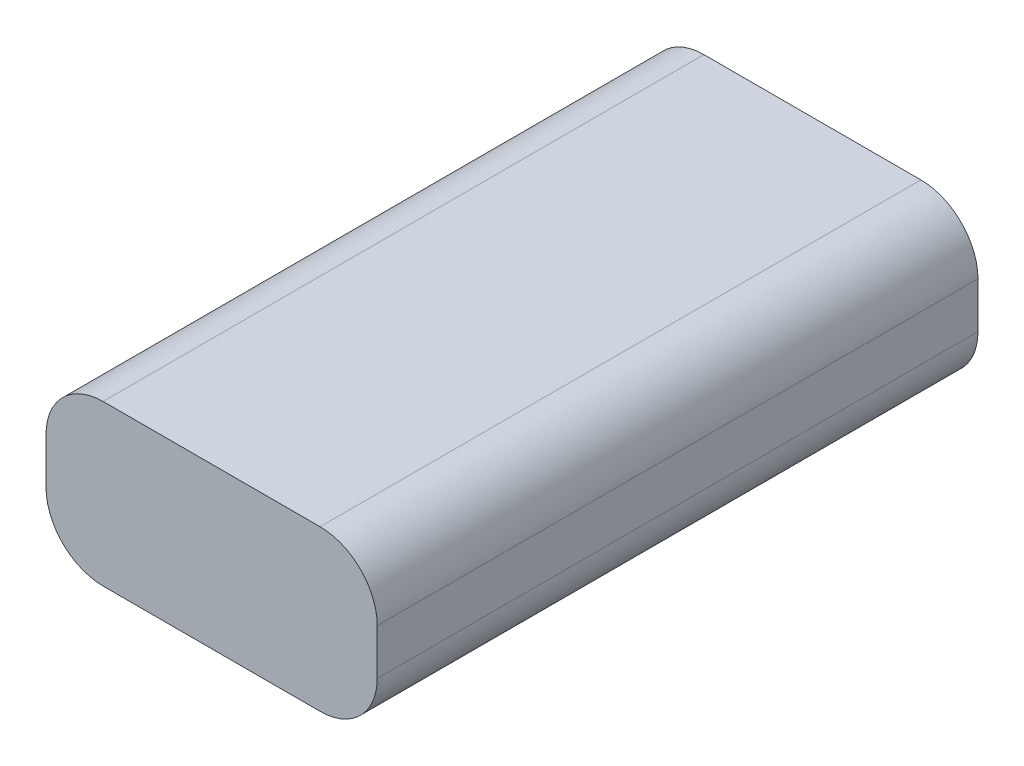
ISO-10303-21;
HEADER;
FILE_DESCRIPTION(('STEP AP214'),'2;1');
FILE_NAME('part.step','',(''),(''),'','','');
FILE_SCHEMA(('AUTOMOTIVE_DESIGN { 1 0 10303 214 1 1 1 1 }'));
ENDSEC;
DATA;
#1=APPLICATION_CONTEXT('core data for automotive mechanical design processes');
#2=APPLICATION_PROTOCOL_DEFINITION('international standard','automotive_design',2000,#1);
#3=PRODUCT_CONTEXT('',#1,'mechanical');
#4=PRODUCT('Part','Part','',(#3));
#5=PRODUCT_RELATED_PRODUCT_CATEGORY('part','',(#4));
#6=PRODUCT_DEFINITION_FORMATION('','',#4);
#7=PRODUCT_DEFINITION_CONTEXT('part definition',#1,'design');
#8=PRODUCT_DEFINITION('design','',#6,#7);
#9=PRODUCT_DEFINITION_SHAPE('','',#8);
#10=(LENGTH_UNIT() NAMED_UNIT(*) SI_UNIT(.MILLI.,.METRE.));
#11=(NAMED_UNIT(*) PLANE_ANGLE_UNIT() SI_UNIT($,.RADIAN.));
#12=(NAMED_UNIT(*) SI_UNIT($,.STERADIAN.) SOLID_ANGLE_UNIT());
#13=UNCERTAINTY_MEASURE_WITH_UNIT(LENGTH_MEASURE(1.E-05),#10,'distance_accuracy_value','');
#14=(GEOMETRIC_REPRESENTATION_CONTEXT(3) GLOBAL_UNCERTAINTY_ASSIGNED_CONTEXT((#13)) GLOBAL_UNIT_ASSIGNED_CONTEXT((#10,
#11,#12)) REPRESENTATION_CONTEXT('',''));
#15=CARTESIAN_POINT('',(0.,0.,0.));
#16=DIRECTION('',(0.,0.,1.));
#17=DIRECTION('',(1.,0.,0.));
#18=AXIS2_PLACEMENT_3D('',#15,#16,#17);
#19=CARTESIAN_POINT('',(-18.415,17.78,33.401));
#20=DIRECTION('',(1.,0.,0.));
#21=DIRECTION('',(0.,0.,-1.));
#22=AXIS2_PLACEMENT_3D('',#19,#20,#21);
#23=PLANE('',#22);
#24=DIRECTION('',(0.,-1.,0.));
#25=VECTOR('',#24,1.);
#26=CARTESIAN_POINT('',(-18.415,17.78,-33.401));
#27=LINE('',#26,#25);
#28=CARTESIAN_POINT('',(-18.415,11.43,-33.401));
#29=VERTEX_POINT('',#28);
#30=CARTESIAN_POINT('',(-18.415,6.35,-33.401));
#31=VERTEX_POINT('',#30);
#32=EDGE_CURVE('E120',#29,#31,#27,.T.);
#33=ORIENTED_EDGE('',*,*,#32,.T.);
#34=DIRECTION('',(0.,0.,1.));
#35=VECTOR('',#34,1.);
#36=CARTESIAN_POINT('',(-18.415,6.35,33.401));
#37=LINE('',#36,#35);
#38=CARTESIAN_POINT('',(-18.415,6.35,33.401));
#39=VERTEX_POINT('',#38);
#40=EDGE_CURVE('E11',#31,#39,#37,.T.);
#41=ORIENTED_EDGE('',*,*,#40,.T.);
#42=DIRECTION('',(0.,-1.,0.));
#43=VECTOR('',#42,1.);
#44=CARTESIAN_POINT('',(-18.415,17.78,33.401));
#45=LINE('',#44,#43);
#46=CARTESIAN_POINT('',(-18.415,11.43,33.401));
#47=VERTEX_POINT('',#46);
#48=EDGE_CURVE('E125',#47,#39,#45,.T.);
#49=ORIENTED_EDGE('',*,*,#48,.F.);
#50=DIRECTION('',(0.,0.,1.));
#51=VECTOR('',#50,1.);
#52=CARTESIAN_POINT('',(-18.415,11.43,-33.401));
#53=LINE('',#52,#51);
#54=EDGE_CURVE('E40',#47,#29,#53,.F.);
#55=ORIENTED_EDGE('',*,*,#54,.T.);
#56=EDGE_LOOP('',(#33,#41,#49,#55));
#57=FACE_BOUND('',#56,.T.);
#58=ADVANCED_FACE('F32',(#57),#23,.F.);
#59=CARTESIAN_POINT('',(18.415,17.78,33.401));
#60=DIRECTION('',(0.,0.,-1.));
#61=DIRECTION('',(-1.,0.,0.));
#62=AXIS2_PLACEMENT_3D('',#59,#60,#61);
#63=PLANE('',#62);
#64=DIRECTION('',(1.,0.,0.));
#65=VECTOR('',#64,1.);
#66=CARTESIAN_POINT('',(18.415,0.,33.401));
#67=LINE('',#66,#65);
#68=CARTESIAN_POINT('',(-12.065,0.,33.401));
#69=VERTEX_POINT('',#68);
#70=CARTESIAN_POINT('',(12.065,0.,33.401));
#71=VERTEX_POINT('',#70);
#72=EDGE_CURVE('E167',#69,#71,#67,.T.);
#73=ORIENTED_EDGE('',*,*,#72,.T.);
#74=CARTESIAN_POINT('',(12.065,6.35,33.401));
#75=DIRECTION('',(0.,0.,-1.));
#76=DIRECTION('',(-1.,0.,0.));
#77=AXIS2_PLACEMENT_3D('',#74,#75,#76);
#78=CIRCLE('',#77,6.35);
#79=CARTESIAN_POINT('',(18.415,6.35,33.401));
#80=VERTEX_POINT('',#79);
#81=EDGE_CURVE('E142',#71,#80,#78,.F.);
#82=ORIENTED_EDGE('',*,*,#81,.T.);
#83=DIRECTION('',(0.,-1.,0.));
#84=VECTOR('',#83,1.);
#85=CARTESIAN_POINT('',(18.415,17.78,33.401));
#86=LINE('',#85,#84);
#87=CARTESIAN_POINT('',(18.415,11.43,33.401));
#88=VERTEX_POINT('',#87);
#89=EDGE_CURVE('E119',#88,#80,#86,.T.);
#90=ORIENTED_EDGE('',*,*,#89,.F.);
#91=CARTESIAN_POINT('',(12.065,11.43,33.401));
#92=DIRECTION('',(0.,0.,-1.));
#93=DIRECTION('',(-1.,0.,0.));
#94=AXIS2_PLACEMENT_3D('',#91,#92,#93);
#95=CIRCLE('',#94,6.35);
#96=CARTESIAN_POINT('',(12.065,17.78,33.401));
#97=VERTEX_POINT('',#96);
#98=EDGE_CURVE('E124',#88,#97,#95,.F.);
#99=ORIENTED_EDGE('',*,*,#98,.T.);
#100=DIRECTION('',(1.,0.,0.));
#101=VECTOR('',#100,1.);
#102=CARTESIAN_POINT('',(18.415,17.78,33.401));
#103=LINE('',#102,#101);
#104=CARTESIAN_POINT('',(-12.065,17.78,33.401));
#105=VERTEX_POINT('',#104);
#106=EDGE_CURVE('E161',#105,#97,#103,.T.);
#107=ORIENTED_EDGE('',*,*,#106,.F.);
#108=CARTESIAN_POINT('',(-12.065,11.43,33.401));
#109=DIRECTION('',(0.,0.,-1.));
#110=DIRECTION('',(-1.,0.,0.));
#111=AXIS2_PLACEMENT_3D('',#108,#109,#110);
#112=CIRCLE('',#111,6.35);
#113=EDGE_CURVE('E54',#105,#47,#112,.F.);
#114=ORIENTED_EDGE('',*,*,#113,.T.);
#115=ORIENTED_EDGE('',*,*,#48,.T.);
#116=CARTESIAN_POINT('',(-12.065,6.35,33.401));
#117=DIRECTION('',(0.,0.,-1.));
#118=DIRECTION('',(-1.,0.,0.));
#119=AXIS2_PLACEMENT_3D('',#116,#117,#118);
#120=CIRCLE('',#119,6.35);
#121=EDGE_CURVE('E47',#39,#69,#120,.F.);
#122=ORIENTED_EDGE('',*,*,#121,.T.);
#123=EDGE_LOOP('',(#73,#82,#90,#99,#107,#114,#115,#122));
#124=FACE_BOUND('',#123,.T.);
#125=ADVANCED_FACE('F163',(#124),#63,.F.);
#126=CARTESIAN_POINT('',(18.415,17.78,33.401));
#127=DIRECTION('',(-1.,0.,0.));
#128=DIRECTION('',(0.,0.,1.));
#129=AXIS2_PLACEMENT_3D('',#126,#127,#128);
#130=PLANE('',#129);
#131=ORIENTED_EDGE('',*,*,#89,.T.);
#132=DIRECTION('',(0.,0.,-1.));
#133=VECTOR('',#132,1.);
#134=CARTESIAN_POINT('',(18.415,6.35,33.401));
#135=LINE('',#134,#133);
#136=CARTESIAN_POINT('',(18.415,6.35,-33.401));
#137=VERTEX_POINT('',#136);
#138=EDGE_CURVE('E118',#80,#137,#135,.T.);
#139=ORIENTED_EDGE('',*,*,#138,.T.);
#140=DIRECTION('',(0.,-1.,0.));
#141=VECTOR('',#140,1.);
#142=CARTESIAN_POINT('',(18.415,17.78,-33.401));
#143=LINE('',#142,#141);
#144=CARTESIAN_POINT('',(18.415,11.43,-33.401));
#145=VERTEX_POINT('',#144);
#146=EDGE_CURVE('E101',#145,#137,#143,.T.);
#147=ORIENTED_EDGE('',*,*,#146,.F.);
#148=DIRECTION('',(0.,0.,-1.));
#149=VECTOR('',#148,1.);
#150=CARTESIAN_POINT('',(18.415,11.43,33.401));
#151=LINE('',#150,#149);
#152=EDGE_CURVE('E115',#145,#88,#151,.F.);
#153=ORIENTED_EDGE('',*,*,#152,.T.);
#154=EDGE_LOOP('',(#131,#139,#147,#153));
#155=FACE_BOUND('',#154,.T.);
#156=ADVANCED_FACE('F114',(#155),#130,.F.);
#157=CARTESIAN_POINT('',(18.415,17.78,-33.401));
#158=DIRECTION('',(0.,0.,1.));
#159=DIRECTION('',(1.,0.,0.));
#160=AXIS2_PLACEMENT_3D('',#157,#158,#159);
#161=PLANE('',#160);
#162=ORIENTED_EDGE('',*,*,#146,.T.);
#163=CARTESIAN_POINT('',(12.065,6.35,-33.401));
#164=DIRECTION('',(0.,0.,1.));
#165=DIRECTION('',(1.,0.,0.));
#166=AXIS2_PLACEMENT_3D('',#163,#164,#165);
#167=CIRCLE('',#166,6.35);
#168=CARTESIAN_POINT('',(12.065,0.,-33.401));
#169=VERTEX_POINT('',#168);
#170=EDGE_CURVE('E108',#137,#169,#167,.F.);
#171=ORIENTED_EDGE('',*,*,#170,.T.);
#172=DIRECTION('',(-1.,0.,0.));
#173=VECTOR('',#172,1.);
#174=CARTESIAN_POINT('',(18.415,0.,-33.401));
#175=LINE('',#174,#173);
#176=CARTESIAN_POINT('',(-12.065,0.,-33.401));
#177=VERTEX_POINT('',#176);
#178=EDGE_CURVE('E164',#169,#177,#175,.T.);
#179=ORIENTED_EDGE('',*,*,#178,.T.);
#180=CARTESIAN_POINT('',(-12.065,6.35,-33.401));
#181=DIRECTION('',(0.,0.,1.));
#182=DIRECTION('',(1.,0.,0.));
#183=AXIS2_PLACEMENT_3D('',#180,#181,#182);
#184=CIRCLE('',#183,6.35);
#185=EDGE_CURVE('E109',#177,#31,#184,.F.);
#186=ORIENTED_EDGE('',*,*,#185,.T.);
#187=ORIENTED_EDGE('',*,*,#32,.F.);
#188=CARTESIAN_POINT('',(-12.065,11.43,-33.401));
#189=DIRECTION('',(0.,0.,1.));
#190=DIRECTION('',(1.,0.,0.));
#191=AXIS2_PLACEMENT_3D('',#188,#189,#190);
#192=CIRCLE('',#191,6.35);
#193=CARTESIAN_POINT('',(-12.065,17.78,-33.401));
#194=VERTEX_POINT('',#193);
#195=EDGE_CURVE('E127',#29,#194,#192,.F.);
#196=ORIENTED_EDGE('',*,*,#195,.T.);
#197=DIRECTION('',(-1.,0.,0.));
#198=VECTOR('',#197,1.);
#199=CARTESIAN_POINT('',(18.415,17.78,-33.401));
#200=LINE('',#199,#198);
#201=CARTESIAN_POINT('',(12.065,17.78,-33.401));
#202=VERTEX_POINT('',#201);
#203=EDGE_CURVE('E103',#202,#194,#200,.T.);
#204=ORIENTED_EDGE('',*,*,#203,.F.);
#205=CARTESIAN_POINT('',(12.065,11.43,-33.401));
#206=DIRECTION('',(0.,0.,1.));
#207=DIRECTION('',(1.,0.,0.));
#208=AXIS2_PLACEMENT_3D('',#205,#206,#207);
#209=CIRCLE('',#208,6.35);
#210=EDGE_CURVE('E98',#202,#145,#209,.F.);
#211=ORIENTED_EDGE('',*,*,#210,.T.);
#212=EDGE_LOOP('',(#162,#171,#179,#186,#187,#196,#204,#211));
#213=FACE_BOUND('',#212,.T.);
#214=ADVANCED_FACE('F100',(#213),#161,.F.);
#215=CARTESIAN_POINT('',(0.,17.78,0.));
#216=DIRECTION('',(0.,1.,0.));
#217=DIRECTION('',(0.,0.,1.));
#218=AXIS2_PLACEMENT_3D('',#215,#216,#217);
#219=PLANE('',#218);
#220=ORIENTED_EDGE('',*,*,#106,.T.);
#221=DIRECTION('',(0.,0.,-1.));
#222=VECTOR('',#221,1.);
#223=CARTESIAN_POINT('',(12.065,17.78,-33.401));
#224=LINE('',#223,#222);
#225=EDGE_CURVE('E147',#97,#202,#224,.T.);
#226=ORIENTED_EDGE('',*,*,#225,.T.);
#227=ORIENTED_EDGE('',*,*,#203,.T.);
#228=DIRECTION('',(0.,0.,1.));
#229=VECTOR('',#228,1.);
#230=CARTESIAN_POINT('',(-12.065,17.78,33.401));
#231=LINE('',#230,#229);
#232=EDGE_CURVE('E144',#194,#105,#231,.T.);
#233=ORIENTED_EDGE('',*,*,#232,.T.);
#234=EDGE_LOOP('',(#220,#226,#227,#233));
#235=FACE_BOUND('',#234,.T.);
#236=ADVANCED_FACE('F160',(#235),#219,.T.);
#237=CARTESIAN_POINT('',(0.,0.,0.));
#238=DIRECTION('',(0.,1.,0.));
#239=DIRECTION('',(0.,0.,1.));
#240=AXIS2_PLACEMENT_3D('',#237,#238,#239);
#241=PLANE('',#240);
#242=ORIENTED_EDGE('',*,*,#178,.F.);
#243=DIRECTION('',(0.,0.,-1.));
#244=VECTOR('',#243,1.);
#245=CARTESIAN_POINT('',(12.065,0.,0.));
#246=LINE('',#245,#244);
#247=EDGE_CURVE('E137',#169,#71,#246,.F.);
#248=ORIENTED_EDGE('',*,*,#247,.T.);
#249=ORIENTED_EDGE('',*,*,#72,.F.);
#250=DIRECTION('',(0.,0.,1.));
#251=VECTOR('',#250,1.);
#252=CARTESIAN_POINT('',(-12.065,0.,0.));
#253=LINE('',#252,#251);
#254=EDGE_CURVE('E135',#69,#177,#253,.F.);
#255=ORIENTED_EDGE('',*,*,#254,.T.);
#256=EDGE_LOOP('',(#242,#248,#249,#255));
#257=FACE_BOUND('',#256,.T.);
#258=ADVANCED_FACE('F176',(#257),#241,.F.);
#259=CARTESIAN_POINT('',(12.065,6.35,33.401));
#260=DIRECTION('',(0.,0.,-1.));
#261=DIRECTION('',(-1.,0.,0.));
#262=AXIS2_PLACEMENT_3D('',#259,#260,#261);
#263=CYLINDRICAL_SURFACE('',#262,6.35);
#264=ORIENTED_EDGE('',*,*,#81,.F.);
#265=ORIENTED_EDGE('',*,*,#247,.F.);
#266=ORIENTED_EDGE('',*,*,#170,.F.);
#267=ORIENTED_EDGE('',*,*,#138,.F.);
#268=EDGE_LOOP('',(#264,#265,#266,#267));
#269=FACE_BOUND('',#268,.T.);
#270=ADVANCED_FACE('F172',(#269),#263,.T.);
#271=CARTESIAN_POINT('',(12.065,11.43,0.));
#272=DIRECTION('',(0.,0.,1.));
#273=DIRECTION('',(1.,0.,0.));
#274=AXIS2_PLACEMENT_3D('',#271,#272,#273);
#275=CYLINDRICAL_SURFACE('',#274,6.35);
#276=ORIENTED_EDGE('',*,*,#98,.F.);
#277=ORIENTED_EDGE('',*,*,#152,.F.);
#278=ORIENTED_EDGE('',*,*,#210,.F.);
#279=ORIENTED_EDGE('',*,*,#225,.F.);
#280=EDGE_LOOP('',(#276,#277,#278,#279));
#281=FACE_BOUND('',#280,.T.);
#282=ADVANCED_FACE('F123',(#281),#275,.T.);
#283=CARTESIAN_POINT('',(-12.065,6.35,33.401));
#284=DIRECTION('',(0.,0.,1.));
#285=DIRECTION('',(1.,0.,0.));
#286=AXIS2_PLACEMENT_3D('',#283,#284,#285);
#287=CYLINDRICAL_SURFACE('',#286,6.35);
#288=ORIENTED_EDGE('',*,*,#185,.F.);
#289=ORIENTED_EDGE('',*,*,#254,.F.);
#290=ORIENTED_EDGE('',*,*,#121,.F.);
#291=ORIENTED_EDGE('',*,*,#40,.F.);
#292=EDGE_LOOP('',(#288,#289,#290,#291));
#293=FACE_BOUND('',#292,.T.);
#294=ADVANCED_FACE('F178',(#293),#287,.T.);
#295=CARTESIAN_POINT('',(-12.065,11.43,0.));
#296=DIRECTION('',(0.,0.,-1.));
#297=DIRECTION('',(-1.,0.,0.));
#298=AXIS2_PLACEMENT_3D('',#295,#296,#297);
#299=CYLINDRICAL_SURFACE('',#298,6.35);
#300=ORIENTED_EDGE('',*,*,#195,.F.);
#301=ORIENTED_EDGE('',*,*,#54,.F.);
#302=ORIENTED_EDGE('',*,*,#113,.F.);
#303=ORIENTED_EDGE('',*,*,#232,.F.);
#304=EDGE_LOOP('',(#300,#301,#302,#303));
#305=FACE_BOUND('',#304,.T.);
#306=ADVANCED_FACE('F34',(#305),#299,.T.);
#307=CLOSED_SHELL('',(#58,#125,#156,#214,#236,#258,#270,#282,#294,#306));
#308=MANIFOLD_SOLID_BREP('B2',#307);
#309=ADVANCED_BREP_SHAPE_REPRESENTATION('',(#18,#308),#14);
#310=SHAPE_DEFINITION_REPRESENTATION(#9,#309);
ENDSEC;
END-ISO-10303-21;
